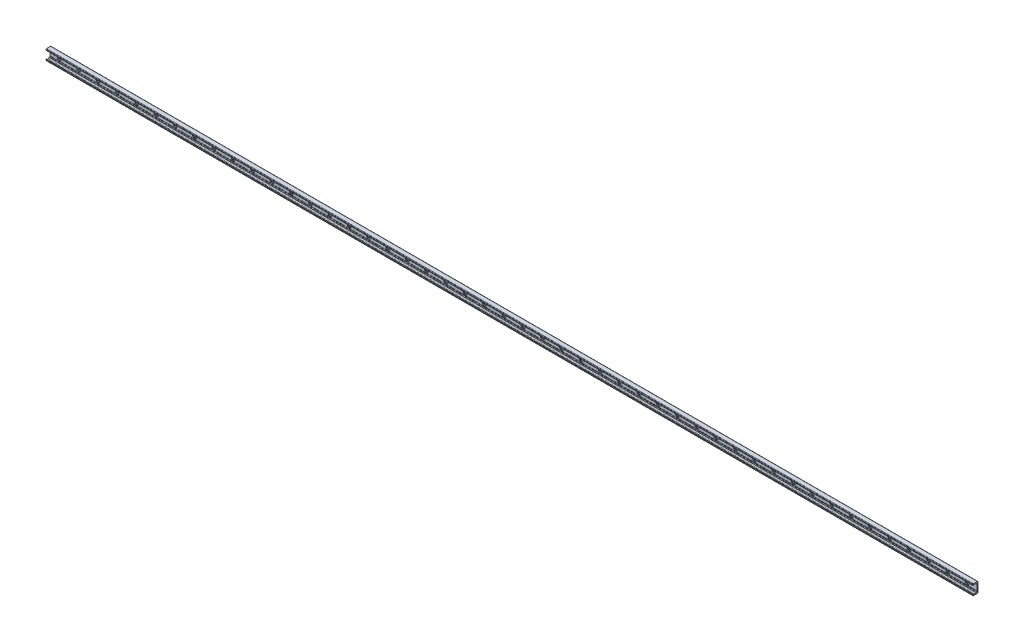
from build123d import *

# Parameters (mm, degrees)
BOSS_EXTRUDE1_DEPTH = 1920
SKETCH2_R           = 9
SKETCH2_R_2         = 4.5
CUT_EXTRUDE1_DEPTH  = 3.1
SKETCH2_2_R         = 4.5
CUT_EXTRUDE2_DEPTH  = 1921.191266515
LPATTERN1_COUNT     = 48
LPATTERN1_PITCH     = 80


with BuildPart() as part:
    # Sketch1 → Boss-Extrude1 (new, symmetric)
    with BuildSketch(Plane(origin=(0, 0, 0), x_dir=(0, 0, -1), z_dir=(1, 0, 0))):
        with BuildLine():
            Line((0, 0), (0, 19))
            ThreePointArc((0, 19), (-0.732233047, 20.767766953), (-2.5, 21.5))
            Line((-2.5, 21.5), (-19, 21.5))
            ThreePointArc((-19, 21.5), (-20.414213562, 20.914213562), (-21, 19.5))
            Line((-21, 19.5), (-21, 16.625057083))
            ThreePointArc((-21, 16.625057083), (-20.553251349, 15.888838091), (-19.693931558, 15.945160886))
            Line((-19.693931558, 15.945160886), (-16.794305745, 17.975500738))
            ThreePointArc((-16.794305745, 17.975500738), (-14.5, 18.69889256), (-12.205694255, 17.975500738))
            Line((-12.205694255, 17.975500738), (-8.829831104, 15.611695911))
            ThreePointArc((-8.829831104, 15.611695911), (-8.28408983, 15.342566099), (-7.682678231, 15.25))
            Line((-7.682678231, 15.25), (-6.5, 15.25))
            ThreePointArc((-6.5, 15.25), (-5.085786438, 14.664213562), (-4.5, 13.25))
            Line((-4.5, 13.25), (-4.5, -10.75))
            ThreePointArc((-4.5, -10.75), (-4.25, -11), (-4.5, -11.25))
            Line((-4.5, -11.25), (-4.5, -12.25))
            ThreePointArc((-4.5, -12.25), (-4.25, -12.5), (-4.5, -12.75))
            Line((-4.5, -12.75), (-4.5, -13.25))
            ThreePointArc((-4.5, -13.25), (-5.085786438, -14.664213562), (-6.5, -15.25))
            Line((-6.5, -15.25), (-7.682678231, -15.25))
            ThreePointArc((-7.682678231, -15.25), (-8.28408983, -15.342566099), (-8.829831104, -15.611695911))
            Line((-8.829831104, -15.611695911), (-12.205694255, -17.975500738))
            ThreePointArc((-12.205694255, -17.975500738), (-14.5, -18.69889256), (-16.794305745, -17.975500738))
            Line((-16.794305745, -17.975500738), (-19.693931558, -15.945160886))
            ThreePointArc((-19.693931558, -15.945160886), (-20.553251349, -15.888838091), (-21, -16.625057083))
            Line((-21, -16.625057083), (-21, -19.5))
            ThreePointArc((-21, -19.5), (-20.414213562, -20.914213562), (-19, -21.5))
            Line((-19, -21.5), (-2.5, -21.5))
            ThreePointArc((-2.5, -21.5), (-0.732233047, -20.767766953), (0, -19))
            Line((0, -19), (0, 0))
        make_face()
    extrude(amount=BOSS_EXTRUDE1_DEPTH, both=True)

    # Sketch2 → Cut-Extrude1 (cut)
    with BuildSketch(Plane.XY.offset(4.5)):
        with Locations((1880, 0)):
            Circle(SKETCH2_R)
        with Locations((1880, 0)):
            Circle(SKETCH2_R_2, mode=Mode.SUBTRACT)
    cut_extrude1 = extrude(amount=-CUT_EXTRUDE1_DEPTH, mode=Mode.SUBTRACT)

    # Sketch2_2 → Cut-Extrude2 (cut, through all)
    with BuildSketch(Plane.XY.offset(4.5)):
        with Locations((1880, 0)):
            Circle(SKETCH2_2_R)
    cut_extrude2 = extrude(amount=-CUT_EXTRUDE2_DEPTH, mode=Mode.SUBTRACT)

    # LPattern1: Cut-Extrude1, Cut-Extrude2 ×48
    with Locations(*[(-i * LPATTERN1_PITCH, 0, 0) for i in range(1, LPATTERN1_COUNT)]):
        add(cut_extrude1, mode=Mode.SUBTRACT)
        add(cut_extrude2, mode=Mode.SUBTRACT)


solid = part.part
